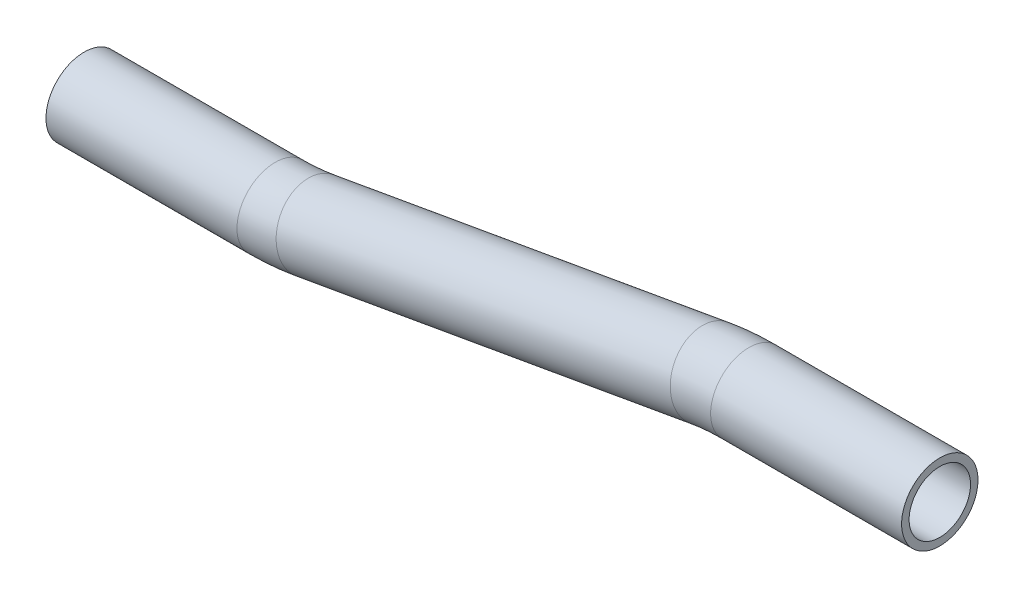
ISO-10303-21;
HEADER;
FILE_DESCRIPTION(('STEP AP214'),'2;1');
FILE_NAME('part.step','',(''),(''),'','','');
FILE_SCHEMA(('AUTOMOTIVE_DESIGN { 1 0 10303 214 1 1 1 1 }'));
ENDSEC;
DATA;
#1=APPLICATION_CONTEXT('core data for automotive mechanical design processes');
#2=APPLICATION_PROTOCOL_DEFINITION('international standard','automotive_design',2000,#1);
#3=PRODUCT_CONTEXT('',#1,'mechanical');
#4=PRODUCT('Part','Part','',(#3));
#5=PRODUCT_RELATED_PRODUCT_CATEGORY('part','',(#4));
#6=PRODUCT_DEFINITION_FORMATION('','',#4);
#7=PRODUCT_DEFINITION_CONTEXT('part definition',#1,'design');
#8=PRODUCT_DEFINITION('design','',#6,#7);
#9=PRODUCT_DEFINITION_SHAPE('','',#8);
#10=(LENGTH_UNIT() NAMED_UNIT(*) SI_UNIT(.MILLI.,.METRE.));
#11=(NAMED_UNIT(*) PLANE_ANGLE_UNIT() SI_UNIT($,.RADIAN.));
#12=(NAMED_UNIT(*) SI_UNIT($,.STERADIAN.) SOLID_ANGLE_UNIT());
#13=UNCERTAINTY_MEASURE_WITH_UNIT(LENGTH_MEASURE(1.E-05),#10,'distance_accuracy_value','');
#14=(GEOMETRIC_REPRESENTATION_CONTEXT(3) GLOBAL_UNCERTAINTY_ASSIGNED_CONTEXT((#13)) GLOBAL_UNIT_ASSIGNED_CONTEXT((#10,
#11,#12)) REPRESENTATION_CONTEXT('',''));
#15=CARTESIAN_POINT('',(0.,0.,0.));
#16=DIRECTION('',(0.,0.,1.));
#17=DIRECTION('',(1.,0.,0.));
#18=AXIS2_PLACEMENT_3D('',#15,#16,#17);
#19=CARTESIAN_POINT('',(110.49,12.7,0.));
#20=DIRECTION('',(1.,0.,0.));
#21=DIRECTION('',(0.,0.,-1.));
#22=AXIS2_PLACEMENT_3D('',#19,#20,#21);
#23=CYLINDRICAL_SURFACE('',#22,6.35);
#24=CARTESIAN_POINT('',(110.49,12.7,0.));
#25=DIRECTION('',(1.,0.,0.));
#26=DIRECTION('',(0.,0.,-1.));
#27=AXIS2_PLACEMENT_3D('',#24,#25,#26);
#28=CIRCLE('',#27,6.35);
#29=CARTESIAN_POINT('',(110.49,19.05,0.));
#30=VERTEX_POINT('',#29);
#31=EDGE_CURVE('E40',#30,#30,#28,.T.);
#32=ORIENTED_EDGE('',*,*,#31,.T.);
#33=EDGE_LOOP('',(#32));
#34=FACE_BOUND('',#33,.T.);
#35=CARTESIAN_POINT('',(142.24,12.7,0.));
#36=DIRECTION('',(1.,0.,0.));
#37=DIRECTION('',(0.,0.,-1.));
#38=AXIS2_PLACEMENT_3D('',#35,#36,#37);
#39=CIRCLE('',#38,6.35);
#40=CARTESIAN_POINT('',(142.24,12.7,-6.35));
#41=VERTEX_POINT('',#40);
#42=EDGE_CURVE('E10',#41,#41,#39,.T.);
#43=ORIENTED_EDGE('',*,*,#42,.F.);
#44=EDGE_LOOP('',(#43));
#45=FACE_BOUND('',#44,.T.);
#46=ADVANCED_FACE('F30',(#34,#45),#23,.T.);
#47=CARTESIAN_POINT('',(110.49,12.7,0.));
#48=DIRECTION('',(1.,0.,0.));
#49=DIRECTION('',(0.,0.,-1.));
#50=AXIS2_PLACEMENT_3D('',#47,#48,#49);
#51=CYLINDRICAL_SURFACE('',#50,5.1054);
#52=CARTESIAN_POINT('',(110.49,12.7,0.));
#53=DIRECTION('',(1.,0.,0.));
#54=DIRECTION('',(0.,0.,-1.));
#55=AXIS2_PLACEMENT_3D('',#52,#53,#54);
#56=CIRCLE('',#55,5.1054);
#57=CARTESIAN_POINT('',(110.49,17.8054,0.));
#58=VERTEX_POINT('',#57);
#59=EDGE_CURVE('E44',#58,#58,#56,.T.);
#60=ORIENTED_EDGE('',*,*,#59,.F.);
#61=EDGE_LOOP('',(#60));
#62=FACE_BOUND('',#61,.T.);
#63=CARTESIAN_POINT('',(142.24,12.7,0.));
#64=DIRECTION('',(1.,0.,0.));
#65=DIRECTION('',(0.,0.,-1.));
#66=AXIS2_PLACEMENT_3D('',#63,#64,#65);
#67=CIRCLE('',#66,5.1054);
#68=CARTESIAN_POINT('',(142.24,12.7,-5.1054));
#69=VERTEX_POINT('',#68);
#70=EDGE_CURVE('E36',#69,#69,#67,.T.);
#71=ORIENTED_EDGE('',*,*,#70,.T.);
#72=EDGE_LOOP('',(#71));
#73=FACE_BOUND('',#72,.T.);
#74=ADVANCED_FACE('F98',(#62,#73),#51,.F.);
#75=CARTESIAN_POINT('',(110.49,-25.4,0.));
#76=DIRECTION('',(0.,0.,-1.));
#77=DIRECTION('',(-1.,0.,0.));
#78=AXIS2_PLACEMENT_3D('',#75,#76,#77);
#79=TOROIDAL_SURFACE('',#78,38.1,6.35);
#80=CARTESIAN_POINT('',(103.878714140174,12.1220055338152,0.));
#81=DIRECTION('',(0.984829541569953,0.173524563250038,0.));
#82=DIRECTION('',(0.,0.,-1.));
#83=AXIS2_PLACEMENT_3D('',#80,#81,#82);
#84=CIRCLE('',#83,6.35);
#85=CARTESIAN_POINT('',(102.776833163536,18.3756731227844,0.));
#86=VERTEX_POINT('',#85);
#87=EDGE_CURVE('E49',#86,#86,#84,.T.);
#88=CARTESIAN_POINT('',(110.49,-25.4,0.));
#89=DIRECTION('',(0.,0.,-1.));
#90=DIRECTION('',(-1.,0.,0.));
#91=AXIS2_PLACEMENT_3D('',#88,#89,#90);
#92=CIRCLE('',#91,44.45);
#93=EDGE_CURVE('',#86,#30,#92,.T.);
#94=ORIENTED_EDGE('',*,*,#87,.T.);
#95=ORIENTED_EDGE('',*,*,#31,.F.);
#96=ORIENTED_EDGE('',*,*,#93,.T.);
#97=ORIENTED_EDGE('',*,*,#93,.F.);
#98=EDGE_LOOP('',(#94,#96,#95,#97));
#99=FACE_BOUND('',#98,.T.);
#100=ADVANCED_FACE('F94',(#99),#79,.T.);
#101=CARTESIAN_POINT('',(110.49,-25.4,0.));
#102=DIRECTION('',(0.,0.,-1.));
#103=DIRECTION('',(-1.,0.,0.));
#104=AXIS2_PLACEMENT_3D('',#101,#102,#103);
#105=TOROIDAL_SURFACE('',#104,38.1,5.1054);
#106=CARTESIAN_POINT('',(103.878714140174,12.1220055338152,0.));
#107=DIRECTION('',(0.984829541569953,0.173524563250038,0.));
#108=DIRECTION('',(0.,0.,-1.));
#109=AXIS2_PLACEMENT_3D('',#106,#107,#108);
#110=CIRCLE('',#109,5.1054);
#111=CARTESIAN_POINT('',(102.992801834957,17.1499542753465,0.));
#112=VERTEX_POINT('',#111);
#113=EDGE_CURVE('E52',#112,#112,#110,.T.);
#114=CARTESIAN_POINT('',(110.49,-25.4,0.));
#115=DIRECTION('',(0.,0.,-1.));
#116=DIRECTION('',(-1.,0.,0.));
#117=AXIS2_PLACEMENT_3D('',#114,#115,#116);
#118=CIRCLE('',#117,43.2054);
#119=EDGE_CURVE('',#112,#58,#118,.T.);
#120=ORIENTED_EDGE('',*,*,#113,.F.);
#121=ORIENTED_EDGE('',*,*,#59,.T.);
#122=ORIENTED_EDGE('',*,*,#119,.T.);
#123=ORIENTED_EDGE('',*,*,#119,.F.);
#124=EDGE_LOOP('',(#120,#122,#121,#123));
#125=FACE_BOUND('',#124,.T.);
#126=ADVANCED_FACE('F91',(#125),#105,.F.);
#127=CARTESIAN_POINT('',(38.3612858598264,0.577994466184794,0.));
#128=DIRECTION('',(0.984829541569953,0.173524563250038,0.));
#129=DIRECTION('',(-0.173524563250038,0.984829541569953,0.));
#130=AXIS2_PLACEMENT_3D('',#127,#128,#129);
#131=CYLINDRICAL_SURFACE('',#130,6.35);
#132=CARTESIAN_POINT('',(38.3612858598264,0.577994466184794,0.));
#133=DIRECTION('',(0.984829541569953,0.173524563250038,0.));
#134=DIRECTION('',(0.,0.,-1.));
#135=AXIS2_PLACEMENT_3D('',#132,#133,#134);
#136=CIRCLE('',#135,6.35);
#137=CARTESIAN_POINT('',(39.4631668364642,-5.67567312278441,0.));
#138=VERTEX_POINT('',#137);
#139=EDGE_CURVE('E55',#138,#138,#136,.T.);
#140=ORIENTED_EDGE('',*,*,#139,.T.);
#141=EDGE_LOOP('',(#140));
#142=FACE_BOUND('',#141,.T.);
#143=ORIENTED_EDGE('',*,*,#87,.F.);
#144=EDGE_LOOP('',(#143));
#145=FACE_BOUND('',#144,.T.);
#146=ADVANCED_FACE('F87',(#142,#145),#131,.T.);
#147=CARTESIAN_POINT('',(38.3612858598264,0.577994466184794,0.));
#148=DIRECTION('',(0.984829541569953,0.173524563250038,0.));
#149=DIRECTION('',(-0.173524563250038,0.984829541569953,0.));
#150=AXIS2_PLACEMENT_3D('',#147,#148,#149);
#151=CYLINDRICAL_SURFACE('',#150,5.1054);
#152=CARTESIAN_POINT('',(38.3612858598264,0.577994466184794,0.));
#153=DIRECTION('',(0.984829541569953,0.173524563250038,0.));
#154=DIRECTION('',(0.,0.,-1.));
#155=AXIS2_PLACEMENT_3D('',#152,#153,#154);
#156=CIRCLE('',#155,5.1054);
#157=CARTESIAN_POINT('',(39.2471981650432,-4.44995427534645,0.));
#158=VERTEX_POINT('',#157);
#159=EDGE_CURVE('E58',#158,#158,#156,.T.);
#160=ORIENTED_EDGE('',*,*,#159,.F.);
#161=EDGE_LOOP('',(#160));
#162=FACE_BOUND('',#161,.T.);
#163=ORIENTED_EDGE('',*,*,#113,.T.);
#164=EDGE_LOOP('',(#163));
#165=FACE_BOUND('',#164,.T.);
#166=ADVANCED_FACE('F84',(#162,#165),#151,.F.);
#167=CARTESIAN_POINT('',(31.75,38.1,0.));
#168=DIRECTION('',(0.,0.,1.));
#169=DIRECTION('',(1.,0.,0.));
#170=AXIS2_PLACEMENT_3D('',#167,#168,#169);
#171=TOROIDAL_SURFACE('',#170,38.1,6.35);
#172=CARTESIAN_POINT('',(31.75,0.,0.));
#173=DIRECTION('',(1.,0.,0.));
#174=DIRECTION('',(0.,0.,-1.));
#175=AXIS2_PLACEMENT_3D('',#172,#173,#174);
#176=CIRCLE('',#175,6.35);
#177=CARTESIAN_POINT('',(31.75,-6.34999999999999,0.));
#178=VERTEX_POINT('',#177);
#179=EDGE_CURVE('E61',#178,#178,#176,.T.);
#180=CARTESIAN_POINT('',(31.75,38.1,0.));
#181=DIRECTION('',(0.,0.,1.));
#182=DIRECTION('',(1.,0.,0.));
#183=AXIS2_PLACEMENT_3D('',#180,#181,#182);
#184=CIRCLE('',#183,44.45);
#185=EDGE_CURVE('',#178,#138,#184,.T.);
#186=ORIENTED_EDGE('',*,*,#179,.T.);
#187=ORIENTED_EDGE('',*,*,#139,.F.);
#188=ORIENTED_EDGE('',*,*,#185,.T.);
#189=ORIENTED_EDGE('',*,*,#185,.F.);
#190=EDGE_LOOP('',(#186,#188,#187,#189));
#191=FACE_BOUND('',#190,.T.);
#192=ADVANCED_FACE('F80',(#191),#171,.T.);
#193=CARTESIAN_POINT('',(31.75,38.1,0.));
#194=DIRECTION('',(0.,0.,1.));
#195=DIRECTION('',(1.,0.,0.));
#196=AXIS2_PLACEMENT_3D('',#193,#194,#195);
#197=TOROIDAL_SURFACE('',#196,38.1,5.1054);
#198=CARTESIAN_POINT('',(31.75,0.,0.));
#199=DIRECTION('',(1.,0.,0.));
#200=DIRECTION('',(0.,0.,-1.));
#201=AXIS2_PLACEMENT_3D('',#198,#199,#200);
#202=CIRCLE('',#201,5.1054);
#203=CARTESIAN_POINT('',(31.75,-5.1054,0.));
#204=VERTEX_POINT('',#203);
#205=EDGE_CURVE('E65',#204,#204,#202,.T.);
#206=CARTESIAN_POINT('',(31.75,38.1,0.));
#207=DIRECTION('',(0.,0.,1.));
#208=DIRECTION('',(1.,0.,0.));
#209=AXIS2_PLACEMENT_3D('',#206,#207,#208);
#210=CIRCLE('',#209,43.2054);
#211=EDGE_CURVE('',#204,#158,#210,.T.);
#212=ORIENTED_EDGE('',*,*,#205,.F.);
#213=ORIENTED_EDGE('',*,*,#159,.T.);
#214=ORIENTED_EDGE('',*,*,#211,.T.);
#215=ORIENTED_EDGE('',*,*,#211,.F.);
#216=EDGE_LOOP('',(#212,#214,#213,#215));
#217=FACE_BOUND('',#216,.T.);
#218=ADVANCED_FACE('F77',(#217),#197,.F.);
#219=CARTESIAN_POINT('',(31.75,0.,0.));
#220=DIRECTION('',(-1.,0.,0.));
#221=DIRECTION('',(0.,0.,1.));
#222=AXIS2_PLACEMENT_3D('',#219,#220,#221);
#223=CYLINDRICAL_SURFACE('',#222,5.1054);
#224=ORIENTED_EDGE('',*,*,#205,.T.);
#225=EDGE_LOOP('',(#224));
#226=FACE_BOUND('',#225,.T.);
#227=CARTESIAN_POINT('',(0.,0.,0.));
#228=DIRECTION('',(1.,0.,0.));
#229=DIRECTION('',(0.,0.,-1.));
#230=AXIS2_PLACEMENT_3D('',#227,#228,#229);
#231=CIRCLE('',#230,5.1054);
#232=CARTESIAN_POINT('',(0.,0.,-5.1054));
#233=VERTEX_POINT('',#232);
#234=EDGE_CURVE('E66',#233,#233,#231,.T.);
#235=ORIENTED_EDGE('',*,*,#234,.F.);
#236=EDGE_LOOP('',(#235));
#237=FACE_BOUND('',#236,.T.);
#238=ADVANCED_FACE('F74',(#226,#237),#223,.F.);
#239=CARTESIAN_POINT('',(31.75,0.,0.));
#240=DIRECTION('',(-1.,0.,0.));
#241=DIRECTION('',(0.,0.,1.));
#242=AXIS2_PLACEMENT_3D('',#239,#240,#241);
#243=CYLINDRICAL_SURFACE('',#242,6.35);
#244=ORIENTED_EDGE('',*,*,#179,.F.);
#245=EDGE_LOOP('',(#244));
#246=FACE_BOUND('',#245,.T.);
#247=CARTESIAN_POINT('',(0.,0.,0.));
#248=DIRECTION('',(1.,0.,0.));
#249=DIRECTION('',(0.,0.,-1.));
#250=AXIS2_PLACEMENT_3D('',#247,#248,#249);
#251=CIRCLE('',#250,6.35);
#252=CARTESIAN_POINT('',(0.,0.,-6.35));
#253=VERTEX_POINT('',#252);
#254=EDGE_CURVE('E62',#253,#253,#251,.T.);
#255=ORIENTED_EDGE('',*,*,#254,.T.);
#256=EDGE_LOOP('',(#255));
#257=FACE_BOUND('',#256,.T.);
#258=ADVANCED_FACE('F116',(#246,#257),#243,.T.);
#259=CARTESIAN_POINT('',(142.24,12.7,0.));
#260=DIRECTION('',(1.,0.,0.));
#261=DIRECTION('',(0.,0.,-1.));
#262=AXIS2_PLACEMENT_3D('',#259,#260,#261);
#263=PLANE('',#262);
#264=ORIENTED_EDGE('',*,*,#70,.F.);
#265=EDGE_LOOP('',(#264));
#266=FACE_BOUND('',#265,.T.);
#267=ORIENTED_EDGE('',*,*,#42,.T.);
#268=EDGE_LOOP('',(#267));
#269=FACE_BOUND('',#268,.T.);
#270=ADVANCED_FACE('F119',(#266,#269),#263,.T.);
#271=CARTESIAN_POINT('',(0.,0.,0.));
#272=DIRECTION('',(1.,0.,0.));
#273=DIRECTION('',(0.,0.,-1.));
#274=AXIS2_PLACEMENT_3D('',#271,#272,#273);
#275=PLANE('',#274);
#276=ORIENTED_EDGE('',*,*,#234,.T.);
#277=EDGE_LOOP('',(#276));
#278=FACE_BOUND('',#277,.T.);
#279=ORIENTED_EDGE('',*,*,#254,.F.);
#280=EDGE_LOOP('',(#279));
#281=FACE_BOUND('',#280,.T.);
#282=ADVANCED_FACE('F121',(#278,#281),#275,.F.);
#283=CLOSED_SHELL('',(#46,#74,#100,#126,#146,#166,#192,#218,#238,#258,#270,#282));
#284=MANIFOLD_SOLID_BREP('B2',#283);
#285=ADVANCED_BREP_SHAPE_REPRESENTATION('',(#18,#284),#14);
#286=SHAPE_DEFINITION_REPRESENTATION(#9,#285);
ENDSEC;
END-ISO-10303-21;
